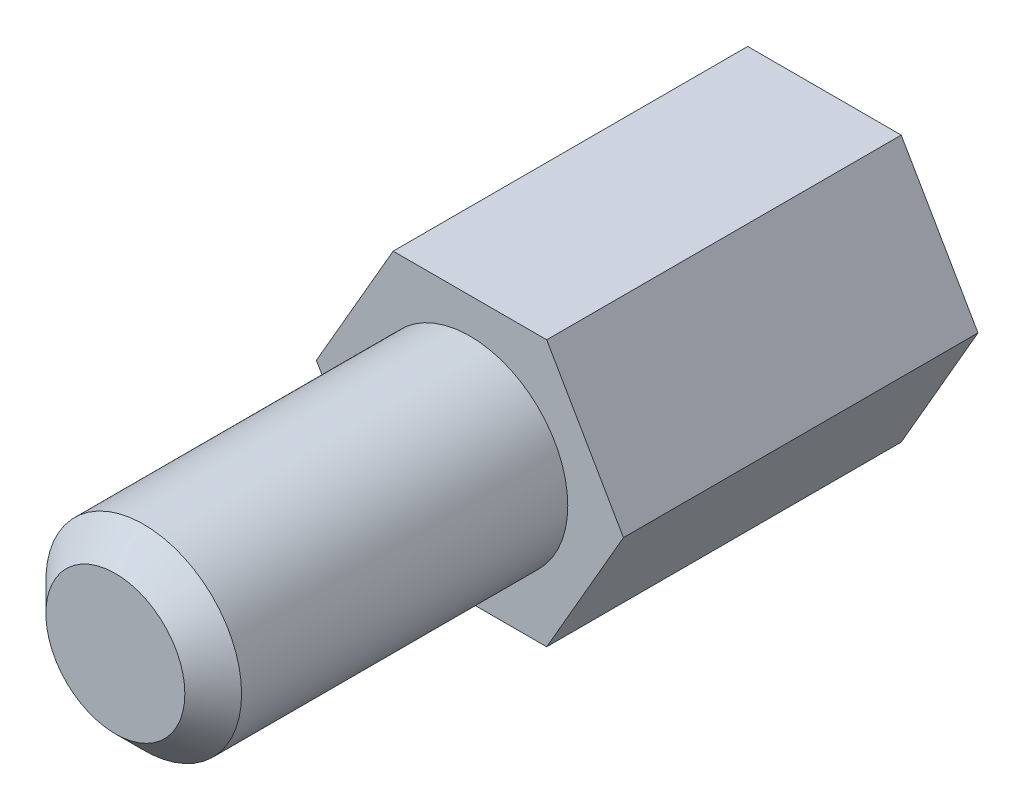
from build123d import *

# Parameters (mm, degrees)
SKETCH1_R           = 1.7526
BASE_EXTRUDE_DEPTH  = 6.35
BOSS_EXTRUDE1_DEPTH = 6.35
CHAMFER1_SIZE       = 0.508
SKETCH3_R           = 1.3208
CUT_EXTRUDE1_DEPTH  = 3.9624


with BuildPart() as part:
    # Sketch1 → Base-Extrude (new body)
    with BuildSketch(Plane.XY):
        Circle(SKETCH1_R)
    extrude(amount=BASE_EXTRUDE_DEPTH)

    # Hexagon - circumscribed1 → Boss-Extrude1 (add)
    with BuildSketch(Plane(origin=(0.343332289, 0.263896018, 0), x_dir=(-1, 0, 0), z_dir=(0, 0, -1))):
        Polygon((-1.031483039, 2.117353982), (1.718147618, 2.117353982), (3.092962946, -0.263896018), (1.718147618, -2.645146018), (-1.031483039, -2.645146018), (-2.406298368, -0.263896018), align=None)
    extrude(amount=BOSS_EXTRUDE1_DEPTH)

    # Chamfer1
    chamfer1_edges = [part.edges().sort_by_distance(p)[0] for p in [
        (-1.7526, 0, 6.35),
    ]]
    chamfer(chamfer1_edges, length=CHAMFER1_SIZE)

    # Sketch3 → Cut-Extrude1 (cut)
    with BuildSketch(Plane(origin=(0, 0, -6.35), x_dir=(-1, 0, 0), z_dir=(0, 0, -1))):
        Circle(SKETCH3_R)
    extrude(amount=-CUT_EXTRUDE1_DEPTH, mode=Mode.SUBTRACT)


solid = part.part
